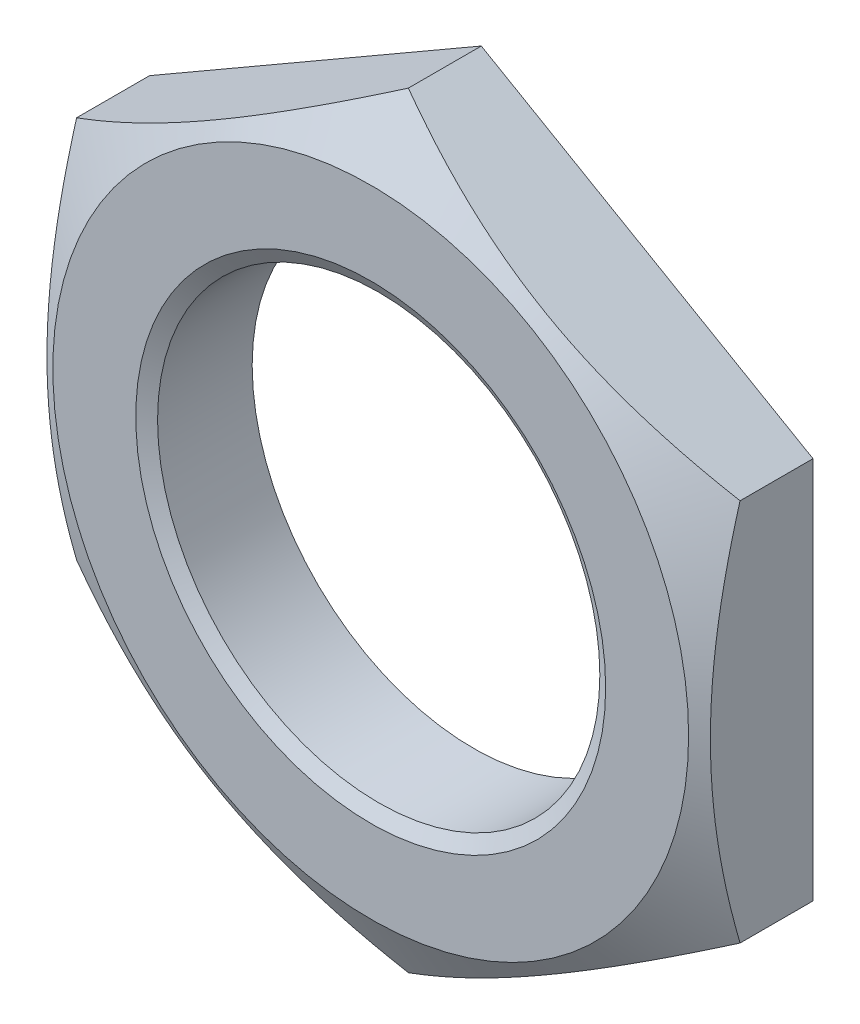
ISO-10303-21;
HEADER;
FILE_DESCRIPTION(('STEP AP214'),'2;1');
FILE_NAME('part.step','',(''),(''),'','','');
FILE_SCHEMA(('AUTOMOTIVE_DESIGN { 1 0 10303 214 1 1 1 1 }'));
ENDSEC;
DATA;
#1=APPLICATION_CONTEXT('core data for automotive mechanical design processes');
#2=APPLICATION_PROTOCOL_DEFINITION('international standard','automotive_design',2000,#1);
#3=PRODUCT_CONTEXT('',#1,'mechanical');
#4=PRODUCT('Part','Part','',(#3));
#5=PRODUCT_RELATED_PRODUCT_CATEGORY('part','',(#4));
#6=PRODUCT_DEFINITION_FORMATION('','',#4);
#7=PRODUCT_DEFINITION_CONTEXT('part definition',#1,'design');
#8=PRODUCT_DEFINITION('design','',#6,#7);
#9=PRODUCT_DEFINITION_SHAPE('','',#8);
#10=(LENGTH_UNIT() NAMED_UNIT(*) SI_UNIT(.MILLI.,.METRE.));
#11=(NAMED_UNIT(*) PLANE_ANGLE_UNIT() SI_UNIT($,.RADIAN.));
#12=(NAMED_UNIT(*) SI_UNIT($,.STERADIAN.) SOLID_ANGLE_UNIT());
#13=UNCERTAINTY_MEASURE_WITH_UNIT(LENGTH_MEASURE(1.E-05),#10,'distance_accuracy_value','');
#14=(GEOMETRIC_REPRESENTATION_CONTEXT(3) GLOBAL_UNCERTAINTY_ASSIGNED_CONTEXT((#13)) GLOBAL_UNIT_ASSIGNED_CONTEXT((#10,
#11,#12)) REPRESENTATION_CONTEXT('',''));
#15=CARTESIAN_POINT('',(0.,0.,0.));
#16=DIRECTION('',(0.,0.,1.));
#17=DIRECTION('',(1.,0.,0.));
#18=AXIS2_PLACEMENT_3D('',#15,#16,#17);
#19=CARTESIAN_POINT('',(-12.,-6.92820323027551,4.));
#20=DIRECTION('',(0.,0.,1.));
#21=DIRECTION('',(1.,0.,0.));
#22=AXIS2_PLACEMENT_3D('',#19,#20,#21);
#23=PLANE('',#22);
#24=CARTESIAN_POINT('',(0.,0.,4.));
#25=DIRECTION('',(0.,0.,1.));
#26=DIRECTION('',(1.,0.,0.));
#27=AXIS2_PLACEMENT_3D('',#24,#25,#26);
#28=CIRCLE('',#27,8.5);
#29=CARTESIAN_POINT('',(8.5,0.,4.));
#30=VERTEX_POINT('',#29);
#31=EDGE_CURVE('E23',#30,#30,#28,.F.);
#32=ORIENTED_EDGE('',*,*,#31,.T.);
#33=EDGE_LOOP('',(#32));
#34=FACE_BOUND('',#33,.T.);
#35=CARTESIAN_POINT('',(0.,0.,4.));
#36=DIRECTION('',(0.,0.,1.));
#37=DIRECTION('',(1.,0.,0.));
#38=AXIS2_PLACEMENT_3D('',#35,#36,#37);
#39=CIRCLE('',#38,11.5);
#40=CARTESIAN_POINT('',(11.5,0.,4.));
#41=VERTEX_POINT('',#40);
#42=EDGE_CURVE('E184',#41,#41,#39,.T.);
#43=ORIENTED_EDGE('',*,*,#42,.T.);
#44=EDGE_LOOP('',(#43));
#45=FACE_BOUND('',#44,.T.);
#46=ADVANCED_FACE('F14',(#34,#45),#23,.T.);
#47=CARTESIAN_POINT('',(-12.,6.92820323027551,4.));
#48=DIRECTION('',(1.,0.,0.));
#49=DIRECTION('',(0.,0.,-1.));
#50=AXIS2_PLACEMENT_3D('',#47,#48,#49);
#51=PLANE('',#50);
#52=CARTESIAN_POINT('',(-12.,-18.7026918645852,-2.19000402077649));
#53=CARTESIAN_POINT('',(-12.,-18.4402475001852,-2.06247742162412));
#54=CARTESIAN_POINT('',(-12.,-18.1774976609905,-1.93557977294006));
#55=CARTESIAN_POINT('',(-12.,-17.651323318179,-1.683184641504));
#56=CARTESIAN_POINT('',(-12.,-17.3878988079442,-1.55768717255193));
#57=CARTESIAN_POINT('',(-12.,-16.5964488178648,-1.18347595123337));
#58=CARTESIAN_POINT('',(-12.,-16.0673230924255,-0.937080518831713));
#59=CARTESIAN_POINT('',(-12.,-15.0027262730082,-0.450637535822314));
#60=CARTESIAN_POINT('',(-12.,-14.4672363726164,-0.210631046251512));
#61=CARTESIAN_POINT('',(-12.,-13.3920303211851,0.259686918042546));
#62=CARTESIAN_POINT('',(-12.,-12.8523143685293,0.48999884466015));
#63=CARTESIAN_POINT('',(-12.,-11.7500310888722,0.945710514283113));
#64=CARTESIAN_POINT('',(-12.,-11.1872942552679,1.17070236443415));
#65=CARTESIAN_POINT('',(-12.,-10.0552673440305,1.60388208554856));
#66=CARTESIAN_POINT('',(-12.,-9.48597654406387,1.81206808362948));
#67=CARTESIAN_POINT('',(-12.,-8.34099020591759,2.20623548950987));
#68=CARTESIAN_POINT('',(-12.,-7.76530999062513,2.39226105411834));
#69=CARTESIAN_POINT('',(-12.,-6.60563781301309,2.73621062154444));
#70=CARTESIAN_POINT('',(-12.,-6.02164850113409,2.89414337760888));
#71=CARTESIAN_POINT('',(-12.,-5.14094093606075,3.10387157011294));
#72=CARTESIAN_POINT('',(-12.,-4.84740487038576,3.16910884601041));
#73=CARTESIAN_POINT('',(-12.,-4.25830992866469,3.28975794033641));
#74=CARTESIAN_POINT('',(-12.,-3.96275109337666,3.34516995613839));
#75=CARTESIAN_POINT('',(-12.,-3.36980777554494,3.44519616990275));
#76=CARTESIAN_POINT('',(-12.,-3.07242332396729,3.48981055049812));
#77=CARTESIAN_POINT('',(-12.,-2.47613613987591,3.56735509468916));
#78=CARTESIAN_POINT('',(-12.,-2.17723346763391,3.60028571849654));
#79=CARTESIAN_POINT('',(-12.,-1.58227121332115,3.65339038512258));
#80=CARTESIAN_POINT('',(-12.,-1.2862262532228,3.67372724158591));
#81=CARTESIAN_POINT('',(-12.,-0.693541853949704,3.70185837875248));
#82=CARTESIAN_POINT('',(-12.,-0.396902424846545,3.70965287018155));
#83=CARTESIAN_POINT('',(-12.,0.196441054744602,3.7125135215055));
#84=CARTESIAN_POINT('',(-12.,0.49314510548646,3.70757963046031));
#85=CARTESIAN_POINT('',(-12.,1.08607871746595,3.6851049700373));
#86=CARTESIAN_POINT('',(-12.,1.38230825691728,3.66756363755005));
#87=CARTESIAN_POINT('',(-12.,2.09142576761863,3.61085738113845));
#88=CARTESIAN_POINT('',(-12.,2.50385629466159,3.56586723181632));
#89=CARTESIAN_POINT('',(-12.,3.32571990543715,3.45387669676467));
#90=CARTESIAN_POINT('',(-12.,3.73515258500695,3.38687339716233));
#91=CARTESIAN_POINT('',(-12.,4.55060757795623,3.2332398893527));
#92=CARTESIAN_POINT('',(-12.,4.95662704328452,3.14659470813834));
#93=CARTESIAN_POINT('',(-12.,5.76462450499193,2.95632632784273));
#94=CARTESIAN_POINT('',(-12.,6.16660255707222,2.85270336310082));
#95=CARTESIAN_POINT('',(-12.,6.9754650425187,2.62852726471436));
#96=CARTESIAN_POINT('',(-12.,7.38225831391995,2.50764748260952));
#97=CARTESIAN_POINT('',(-12.,8.19183855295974,2.25321174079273));
#98=CARTESIAN_POINT('',(-12.,8.5946254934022,2.11965569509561));
#99=CARTESIAN_POINT('',(-12.,9.39638951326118,1.84200441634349));
#100=CARTESIAN_POINT('',(-12.,9.79536776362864,1.69791254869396));
#101=CARTESIAN_POINT('',(-12.,10.5900051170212,1.40090320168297));
#102=CARTESIAN_POINT('',(-12.,10.9856642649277,1.2479858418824));
#103=CARTESIAN_POINT('',(-12.,11.9426036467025,0.867821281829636));
#104=CARTESIAN_POINT('',(-12.,12.5023625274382,0.636749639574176));
#105=CARTESIAN_POINT('',(-12.,13.6169231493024,0.162909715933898));
#106=CARTESIAN_POINT('',(-12.,14.1717245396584,-0.079859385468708));
#107=CARTESIAN_POINT('',(-12.,15.2773320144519,-0.574673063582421));
#108=CARTESIAN_POINT('',(-12.,15.8281370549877,-0.826719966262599));
#109=CARTESIAN_POINT('',(-12.,16.9263037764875,-1.33815265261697));
#110=CARTESIAN_POINT('',(-12.,17.4736655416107,-1.59753825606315));
#111=CARTESIAN_POINT('',(-12.,18.5661890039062,-2.12254630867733));
#112=CARTESIAN_POINT('',(-12.,19.111347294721,-2.38817583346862));
#113=CARTESIAN_POINT('',(-12.,20.1992771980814,-2.92427788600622));
#114=CARTESIAN_POINT('',(-12.,20.7420487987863,-3.19475043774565));
#115=CARTESIAN_POINT('',(-12.,21.8255045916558,-3.73964525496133));
#116=CARTESIAN_POINT('',(-12.,22.3661890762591,-4.01406693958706));
#117=CARTESIAN_POINT('',(-12.,23.4458588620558,-4.56623462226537));
#118=CARTESIAN_POINT('',(-12.,23.9848441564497,-4.84398063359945));
#119=CARTESIAN_POINT('',(-12.,25.5049720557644,-5.63229500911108));
#120=CARTESIAN_POINT('',(-12.,26.4844374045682,-6.14609747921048));
#121=CARTESIAN_POINT('',(-12.,28.4397743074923,-7.18057337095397));
#122=CARTESIAN_POINT('',(-12.,29.4156457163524,-7.70124706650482));
#123=CARTESIAN_POINT('',(-12.,31.3619734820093,-8.74642906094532));
#124=CARTESIAN_POINT('',(-12.,32.3324373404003,-9.27092339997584));
#125=CARTESIAN_POINT('',(-12.,33.7864498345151,-10.0606920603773));
#126=CARTESIAN_POINT('',(-12.,34.2708260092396,-10.324445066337));
#127=CARTESIAN_POINT('',(-12.,35.2390824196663,-10.8528581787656));
#128=CARTESIAN_POINT('',(-12.,35.7229626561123,-11.1175182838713));
#129=CARTESIAN_POINT('',(-12.,36.2066234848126,-11.3825788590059));
#130=B_SPLINE_CURVE_WITH_KNOTS('',3,(#52,#53,#54,#55,#56,#57,#58,#59,#60,#61,#62,#63,#64,#65,
#66,#67,#68,#69,#70,#71,#72,#73,#74,#75,#76,#77,#78,#79,#80,#81,#82,#83,#84,#85,#86,#87,#88,#89,
#90,#91,#92,#93,#94,#95,#96,#97,#98,#99,#100,#101,#102,#103,#104,#105,#106,#107,#108,#109,#110,
#111,#112,#113,#114,#115,#116,#117,#118,#119,#120,#121,#122,#123,#124,#125,#126,#127,#128,#129),
.UNSPECIFIED.,.F.,.F.,(4,2,2,2,2,2,2,2,2,2,2,2,2,2,2,2,2,2,2,2,2,2,2,2,2,2,2,2,2,2,2,2,2,2,2,2,
2,2,4),(0.,0.875361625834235,1.75073187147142,3.50172668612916,5.26209856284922,
7.02238829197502,8.84032706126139,10.6584681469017,12.4729235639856,14.2868126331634,
15.1887689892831,16.0907072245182,16.9926302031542,17.8945176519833,18.7844876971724,
19.6744427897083,20.5644014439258,21.45439985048,22.6983451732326,23.94245522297,
25.1875168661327,26.4325613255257,27.7054346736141,28.9783166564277,30.2507938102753,
31.5232537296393,33.3398021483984,35.1564780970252,36.9736126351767,38.7907025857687,
40.6099616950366,42.4292298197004,44.2482330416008,46.0672435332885,49.3853502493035,
52.7035896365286,56.0129644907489,57.6675553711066,59.3221437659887),.UNSPECIFIED.);
#131=CARTESIAN_POINT('',(-12.,6.92820323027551,2.63952809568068));
#132=VERTEX_POINT('',#131);
#133=CARTESIAN_POINT('',(-12.,-6.92820323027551,2.63952809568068));
#134=VERTEX_POINT('',#133);
#135=EDGE_CURVE('E69',#132,#134,#130,.F.);
#136=ORIENTED_EDGE('',*,*,#135,.F.);
#137=DIRECTION('',(0.,0.,-1.));
#138=VECTOR('',#137,1.);
#139=CARTESIAN_POINT('',(-12.,6.92820323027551,4.));
#140=LINE('',#139,#138);
#141=CARTESIAN_POINT('',(-12.,6.92820323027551,0.));
#142=VERTEX_POINT('',#141);
#143=EDGE_CURVE('E38',#132,#142,#140,.T.);
#144=ORIENTED_EDGE('',*,*,#143,.T.);
#145=DIRECTION('',(0.,-1.,0.));
#146=VECTOR('',#145,1.);
#147=CARTESIAN_POINT('',(-12.,6.92820323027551,0.));
#148=LINE('',#147,#146);
#149=CARTESIAN_POINT('',(-12.,-6.92820323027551,0.));
#150=VERTEX_POINT('',#149);
#151=EDGE_CURVE('E77',#142,#150,#148,.T.);
#152=ORIENTED_EDGE('',*,*,#151,.T.);
#153=DIRECTION('',(0.,0.,-1.));
#154=VECTOR('',#153,1.);
#155=CARTESIAN_POINT('',(-12.,-6.92820323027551,4.));
#156=LINE('',#155,#154);
#157=EDGE_CURVE('E73',#134,#150,#156,.T.);
#158=ORIENTED_EDGE('',*,*,#157,.F.);
#159=EDGE_LOOP('',(#136,#144,#152,#158));
#160=FACE_BOUND('',#159,.T.);
#161=ADVANCED_FACE('F76',(#160),#51,.F.);
#162=CARTESIAN_POINT('',(-12.,-6.92820323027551,4.));
#163=DIRECTION('',(0.5,0.866025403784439,0.));
#164=DIRECTION('',(-0.866025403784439,0.5,0.));
#165=AXIS2_PLACEMENT_3D('',#162,#163,#164);
#166=PLANE('',#165);
#167=CARTESIAN_POINT('',(-12.0002,-6.92808776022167,2.63946142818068));
#168=CARTESIAN_POINT('',(-11.7364142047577,-7.08038456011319,2.72737523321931));
#169=CARTESIAN_POINT('',(-11.4716448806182,-7.23324920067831,2.81129886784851));
#170=CARTESIAN_POINT('',(-10.9399829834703,-7.54020434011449,2.97005864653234));
#171=CARTESIAN_POINT('',(-10.6730897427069,-7.69429522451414,3.0448918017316));
#172=CARTESIAN_POINT('',(-9.86810959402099,-8.15905073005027,3.25430732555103));
#173=CARTESIAN_POINT('',(-9.3268449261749,-8.47155003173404,3.37342162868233));
#174=CARTESIAN_POINT('',(-8.51686717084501,-8.93919090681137,3.51309380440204));
#175=CARTESIAN_POINT('',(-8.25057389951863,-9.09293539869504,3.55288106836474));
#176=CARTESIAN_POINT('',(-7.71675440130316,-9.40113622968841,3.6196014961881));
#177=CARTESIAN_POINT('',(-7.44922815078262,-9.55559258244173,3.64653441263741));
#178=CARTESIAN_POINT('',(-6.91372963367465,-9.86476279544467,3.68685627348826));
#179=CARTESIAN_POINT('',(-6.64575827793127,-10.0194761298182,3.70026131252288));
#180=CARTESIAN_POINT('',(-6.10956726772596,-10.3290461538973,3.71324177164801));
#181=CARTESIAN_POINT('',(-5.84134762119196,-10.4839028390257,3.71281761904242));
#182=CARTESIAN_POINT('',(-5.33991062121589,-10.7734076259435,3.69910484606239));
#183=CARTESIAN_POINT('',(-5.10665750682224,-10.908076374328,3.68748888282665));
#184=CARTESIAN_POINT('',(-4.64068775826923,-11.1771041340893,3.65401685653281));
#185=CARTESIAN_POINT('',(-4.40797116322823,-11.3114631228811,3.63216006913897));
#186=CARTESIAN_POINT('',(-3.94320092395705,-11.5797983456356,3.57858744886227));
#187=CARTESIAN_POINT('',(-3.71114798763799,-11.7137741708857,3.54686347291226));
#188=CARTESIAN_POINT('',(-3.24813003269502,-11.9810977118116,3.47411308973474));
#189=CARTESIAN_POINT('',(-3.01716508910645,-12.1144453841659,3.43308605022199));
#190=CARTESIAN_POINT('',(-2.31605804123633,-12.5192297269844,3.29501321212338));
#191=CARTESIAN_POINT('',(-1.84794625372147,-12.789494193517,3.18419997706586));
#192=CARTESIAN_POINT('',(-0.918702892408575,-13.3259930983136,2.9326990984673));
#193=CARTESIAN_POINT('',(-0.457559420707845,-13.5922344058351,2.79207052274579));
#194=CARTESIAN_POINT('',(0.000199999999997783,-13.8565219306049,2.63946142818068));
#195=B_SPLINE_CURVE_WITH_KNOTS('',3,(#167,#168,#169,#170,#171,#172,#173,#174,#175,#176,#177,
#178,#179,#180,#181,#182,#183,#184,#185,#186,#187,#188,#189,#190,#191,#192,#193,#194),
.UNSPECIFIED.,.F.,.F.,(4,2,2,2,2,2,2,2,2,2,2,2,2,4),(0.,0.951004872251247,1.90232158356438,
3.80900466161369,4.73894551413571,5.6689042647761,6.59775529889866,7.52657763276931,
8.3351464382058,9.1437724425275,9.95306755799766,10.7624176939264,12.4167102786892,
14.0677556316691),.UNSPECIFIED.);
#196=CARTESIAN_POINT('',(0.,-13.856406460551,2.63952809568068));
#197=VERTEX_POINT('',#196);
#198=EDGE_CURVE('E78',#134,#197,#195,.T.);
#199=ORIENTED_EDGE('',*,*,#198,.F.);
#200=ORIENTED_EDGE('',*,*,#157,.T.);
#201=DIRECTION('',(0.866025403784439,-0.5,0.));
#202=VECTOR('',#201,1.);
#203=CARTESIAN_POINT('',(-12.,-6.92820323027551,0.));
#204=LINE('',#203,#202);
#205=CARTESIAN_POINT('',(0.,-13.856406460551,0.));
#206=VERTEX_POINT('',#205);
#207=EDGE_CURVE('E201',#150,#206,#204,.T.);
#208=ORIENTED_EDGE('',*,*,#207,.T.);
#209=DIRECTION('',(0.,0.,-1.));
#210=VECTOR('',#209,1.);
#211=CARTESIAN_POINT('',(0.,-13.856406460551,4.));
#212=LINE('',#211,#210);
#213=EDGE_CURVE('E95',#197,#206,#212,.T.);
#214=ORIENTED_EDGE('',*,*,#213,.F.);
#215=EDGE_LOOP('',(#199,#200,#208,#214));
#216=FACE_BOUND('',#215,.T.);
#217=ADVANCED_FACE('F156',(#216),#166,.F.);
#218=CARTESIAN_POINT('',(0.,-13.856406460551,4.));
#219=DIRECTION('',(-0.5,0.866025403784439,0.));
#220=DIRECTION('',(-0.866025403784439,-0.5,0.));
#221=AXIS2_PLACEMENT_3D('',#218,#219,#220);
#222=PLANE('',#221);
#223=CARTESIAN_POINT('',(-0.000200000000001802,-13.8565219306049,2.63946142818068));
#224=CARTESIAN_POINT('',(0.263585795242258,-13.7042251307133,2.72737523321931));
#225=CARTESIAN_POINT('',(0.528355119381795,-13.5513604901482,2.81129886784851));
#226=CARTESIAN_POINT('',(1.06001701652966,-13.244405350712,2.97005864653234));
#227=CARTESIAN_POINT('',(1.32691025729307,-13.0903144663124,3.0448918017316));
#228=CARTESIAN_POINT('',(2.13189040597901,-12.6255589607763,3.25430732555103));
#229=CARTESIAN_POINT('',(2.6731550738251,-12.3130596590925,3.37342162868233));
#230=CARTESIAN_POINT('',(3.483132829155,-11.8454187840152,3.51309380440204));
#231=CARTESIAN_POINT('',(3.74942610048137,-11.6916742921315,3.55288106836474));
#232=CARTESIAN_POINT('',(4.28324559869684,-11.3834734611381,3.6196014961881));
#233=CARTESIAN_POINT('',(4.55077184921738,-11.2290171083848,3.64653441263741));
#234=CARTESIAN_POINT('',(5.08627036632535,-10.9198468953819,3.68685627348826));
#235=CARTESIAN_POINT('',(5.35424172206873,-10.7651335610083,3.70026131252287));
#236=CARTESIAN_POINT('',(5.89043273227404,-10.4555635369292,3.71324177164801));
#237=CARTESIAN_POINT('',(6.15865237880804,-10.3007068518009,3.71281761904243));
#238=CARTESIAN_POINT('',(6.66008937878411,-10.011202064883,3.69910484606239));
#239=CARTESIAN_POINT('',(6.89334249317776,-9.87653331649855,3.68748888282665));
#240=CARTESIAN_POINT('',(7.35931224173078,-9.60750555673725,3.65401685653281));
#241=CARTESIAN_POINT('',(7.59202883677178,-9.47314656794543,3.63216006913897));
#242=CARTESIAN_POINT('',(8.05679907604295,-9.20481134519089,3.57858744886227));
#243=CARTESIAN_POINT('',(8.28885201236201,-9.07083551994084,3.54686347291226));
#244=CARTESIAN_POINT('',(8.75186996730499,-8.80351197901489,3.47411308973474));
#245=CARTESIAN_POINT('',(8.98283491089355,-8.67016430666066,3.43308605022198));
#246=CARTESIAN_POINT('',(9.68394195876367,-8.2653799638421,3.29501321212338));
#247=CARTESIAN_POINT('',(10.1520537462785,-7.99511549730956,3.18419997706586));
#248=CARTESIAN_POINT('',(11.0812971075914,-7.45861659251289,2.93269909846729));
#249=CARTESIAN_POINT('',(11.5424405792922,-7.19237528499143,2.79207052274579));
#250=CARTESIAN_POINT('',(12.0002,-6.92808776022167,2.63946142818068));
#251=B_SPLINE_CURVE_WITH_KNOTS('',3,(#223,#224,#225,#226,#227,#228,#229,#230,#231,#232,#233,
#234,#235,#236,#237,#238,#239,#240,#241,#242,#243,#244,#245,#246,#247,#248,#249,#250),
.UNSPECIFIED.,.F.,.F.,(4,2,2,2,2,2,2,2,2,2,2,2,2,4),(0.,0.951004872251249,1.90232158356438,
3.80900466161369,4.73894551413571,5.6689042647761,6.59775529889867,7.52657763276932,
8.3351464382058,9.14377244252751,9.95306755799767,10.7624176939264,12.4167102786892,
14.0677556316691),.UNSPECIFIED.);
#252=CARTESIAN_POINT('',(12.,-6.9282032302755,2.63952809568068));
#253=VERTEX_POINT('',#252);
#254=EDGE_CURVE('E141',#197,#253,#251,.T.);
#255=ORIENTED_EDGE('',*,*,#254,.F.);
#256=ORIENTED_EDGE('',*,*,#213,.T.);
#257=DIRECTION('',(0.866025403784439,0.5,0.));
#258=VECTOR('',#257,1.);
#259=CARTESIAN_POINT('',(0.,-13.856406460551,0.));
#260=LINE('',#259,#258);
#261=CARTESIAN_POINT('',(12.,-6.9282032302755,0.));
#262=VERTEX_POINT('',#261);
#263=EDGE_CURVE('E202',#206,#262,#260,.T.);
#264=ORIENTED_EDGE('',*,*,#263,.T.);
#265=DIRECTION('',(0.,0.,-1.));
#266=VECTOR('',#265,1.);
#267=CARTESIAN_POINT('',(12.,-6.9282032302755,4.));
#268=LINE('',#267,#266);
#269=EDGE_CURVE('E93',#253,#262,#268,.T.);
#270=ORIENTED_EDGE('',*,*,#269,.F.);
#271=EDGE_LOOP('',(#255,#256,#264,#270));
#272=FACE_BOUND('',#271,.T.);
#273=ADVANCED_FACE('F152',(#272),#222,.F.);
#274=CARTESIAN_POINT('',(12.,-6.9282032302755,4.));
#275=DIRECTION('',(-1.,0.,0.));
#276=DIRECTION('',(0.,-1.,0.));
#277=AXIS2_PLACEMENT_3D('',#274,#275,#276);
#278=PLANE('',#277);
#279=CARTESIAN_POINT('',(12.,-18.7026918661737,-2.1900040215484));
#280=CARTESIAN_POINT('',(12.,-18.440247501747,-2.06247742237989));
#281=CARTESIAN_POINT('',(12.,-18.1774976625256,-1.93557977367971));
#282=CARTESIAN_POINT('',(12.,-17.6513233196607,-1.68318464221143));
#283=CARTESIAN_POINT('',(12.,-17.3878988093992,-1.55768717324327));
#284=CARTESIAN_POINT('',(12.,-16.5964488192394,-1.18347595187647));
#285=CARTESIAN_POINT('',(12.,-16.0673230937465,-0.937080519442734));
#286=CARTESIAN_POINT('',(12.,-15.0027262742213,-0.450637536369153));
#287=CARTESIAN_POINT('',(12.,-14.467236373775,-0.210631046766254));
#288=CARTESIAN_POINT('',(12.,-13.3920303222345,0.259686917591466));
#289=CARTESIAN_POINT('',(12.,-12.8523143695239,0.489998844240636));
#290=CARTESIAN_POINT('',(12.,-11.750031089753,0.945710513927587));
#291=CARTESIAN_POINT('',(12.,-11.1872942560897,1.17070236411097));
#292=CARTESIAN_POINT('',(12.,-10.0552673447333,1.60388208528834));
#293=CARTESIAN_POINT('',(12.,-9.4859765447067,1.81206808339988));
#294=CARTESIAN_POINT('',(12.,-8.34099020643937,2.20623548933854));
#295=CARTESIAN_POINT('',(12.,-7.76530999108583,2.39226105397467));
#296=CARTESIAN_POINT('',(12.,-6.60563781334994,2.73621062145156));
#297=CARTESIAN_POINT('',(12.,-6.02164850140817,2.89414337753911));
#298=CARTESIAN_POINT('',(12.,-5.14094093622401,3.1038715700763));
#299=CARTESIAN_POINT('',(12.,-4.84740487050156,3.16910884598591));
#300=CARTESIAN_POINT('',(12.,-4.2583099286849,3.28975794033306));
#301=CARTESIAN_POINT('',(12.,-3.96275109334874,3.34516995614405));
#302=CARTESIAN_POINT('',(12.,-3.36980777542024,3.44519616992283));
#303=CARTESIAN_POINT('',(12.,-3.07242332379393,3.48981055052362));
#304=CARTESIAN_POINT('',(12.,-2.47613613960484,3.56735509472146));
#305=CARTESIAN_POINT('',(12.,-2.17723346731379,3.60028571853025));
#306=CARTESIAN_POINT('',(12.,-1.58227121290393,3.65339038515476));
#307=CARTESIAN_POINT('',(12.,-1.28622625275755,3.67372724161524));
#308=CARTESIAN_POINT('',(12.,-0.6935418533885,3.70185837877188));
#309=CARTESIAN_POINT('',(12.,-0.396902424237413,3.70965287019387));
#310=CARTESIAN_POINT('',(12.,0.196441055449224,3.71251352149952));
#311=CARTESIAN_POINT('',(12.,0.493145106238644,3.70757963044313));
#312=CARTESIAN_POINT('',(12.,1.08607871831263,3.68510496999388));
#313=CARTESIAN_POINT('',(12.,1.38230825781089,3.6675636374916));
#314=CARTESIAN_POINT('',(12.,2.09142576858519,3.61085738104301));
#315=CARTESIAN_POINT('',(12.,2.50385629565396,3.56586723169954));
#316=CARTESIAN_POINT('',(12.,3.32571990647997,3.4538766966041));
#317=CARTESIAN_POINT('',(12.,3.73515258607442,3.38687339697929));
#318=CARTESIAN_POINT('',(12.,4.5506075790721,3.23323988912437));
#319=CARTESIAN_POINT('',(12.,4.95662704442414,3.14659470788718));
#320=CARTESIAN_POINT('',(12.,5.76462450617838,2.95632632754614));
#321=CARTESIAN_POINT('',(12.,6.16660255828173,2.85270336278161));
#322=CARTESIAN_POINT('',(12.,6.97546504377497,2.62852726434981));
#323=CARTESIAN_POINT('',(12.,7.3822583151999,2.50764748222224));
#324=CARTESIAN_POINT('',(12.,8.19183855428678,2.25321174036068));
#325=CARTESIAN_POINT('',(12.,8.59462549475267,2.11965569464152));
#326=CARTESIAN_POINT('',(12.,9.39638951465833,1.84200441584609));
#327=CARTESIAN_POINT('',(12.,9.79536776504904,1.69791254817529));
#328=CARTESIAN_POINT('',(12.,10.5900051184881,1.40090320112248));
#329=CARTESIAN_POINT('',(12.,10.9856642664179,1.24798584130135));
#330=CARTESIAN_POINT('',(12.,11.9426036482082,0.867821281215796));
#331=CARTESIAN_POINT('',(12.,12.5023625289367,0.636749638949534));
#332=CARTESIAN_POINT('',(12.,13.6169231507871,0.162909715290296));
#333=CARTESIAN_POINT('',(12.,14.1717245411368,-0.0798593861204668));
#334=CARTESIAN_POINT('',(12.,15.2773320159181,-0.574673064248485));
#335=CARTESIAN_POINT('',(12.,15.8281370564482,-0.82671996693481));
#336=CARTESIAN_POINT('',(12.,16.9263037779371,-1.33815265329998));
#337=CARTESIAN_POINT('',(12.,17.4736655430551,-1.59753825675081));
#338=CARTESIAN_POINT('',(12.,18.5661890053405,-2.12254630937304));
#339=CARTESIAN_POINT('',(12.,19.1113472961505,-2.38817583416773));
#340=CARTESIAN_POINT('',(12.,20.1992771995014,-2.92427788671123));
#341=CARTESIAN_POINT('',(12.,20.7420488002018,-3.19475043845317));
#342=CARTESIAN_POINT('',(12.,21.8255045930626,-3.73964525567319));
#343=CARTESIAN_POINT('',(12.,22.3661890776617,-4.01406694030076));
#344=CARTESIAN_POINT('',(12.,23.4458588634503,-4.56623462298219));
#345=CARTESIAN_POINT('',(12.,23.9848441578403,-4.84398063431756));
#346=CARTESIAN_POINT('',(12.,25.5049720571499,-5.63229500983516));
#347=CARTESIAN_POINT('',(12.,26.4844374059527,-6.1460974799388));
#348=CARTESIAN_POINT('',(12.,28.4397743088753,-7.18057337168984));
#349=CARTESIAN_POINT('',(12.,29.4156457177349,-7.70124706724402));
#350=CARTESIAN_POINT('',(12.,31.361973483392,-8.74642906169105));
#351=CARTESIAN_POINT('',(12.,32.3324373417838,-9.2709234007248));
#352=CARTESIAN_POINT('',(12.,33.7864498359,-10.0606920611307));
#353=CARTESIAN_POINT('',(12.,34.270826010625,-10.3244450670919));
#354=CARTESIAN_POINT('',(12.,35.2390824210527,-10.8528581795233));
#355=CARTESIAN_POINT('',(12.,35.7229626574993,-11.1175182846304));
#356=CARTESIAN_POINT('',(12.,36.2066234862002,-11.3825788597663));
#357=B_SPLINE_CURVE_WITH_KNOTS('',3,(#279,#280,#281,#282,#283,#284,#285,#286,#287,#288,#289,
#290,#291,#292,#293,#294,#295,#296,#297,#298,#299,#300,#301,#302,#303,#304,#305,#306,#307,#308,
#309,#310,#311,#312,#313,#314,#315,#316,#317,#318,#319,#320,#321,#322,#323,#324,#325,#326,#327,
#328,#329,#330,#331,#332,#333,#334,#335,#336,#337,#338,#339,#340,#341,#342,#343,#344,#345,#346,
#347,#348,#349,#350,#351,#352,#353,#354,#355,#356),.UNSPECIFIED.,.F.,.F.,(4,2,2,2,2,2,2,2,2,2,2,
2,2,2,2,2,2,2,2,2,2,2,2,2,2,2,2,2,2,2,2,2,2,2,2,2,2,2,4),(0.,0.875361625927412,1.75073187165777,
3.5017266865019,5.26209856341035,7.02238829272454,8.8403270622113,10.6584681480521,
12.4729235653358,14.2868126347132,15.1887689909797,16.0907072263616,16.9926302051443,
17.89451765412,18.7844876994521,19.6744427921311,20.5644014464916,21.4543998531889,
22.6983451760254,23.9424552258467,25.1875168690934,26.4325613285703,27.7054346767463,
28.9783166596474,30.2507938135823,31.5232537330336,33.3398021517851,35.1564781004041,
36.9736126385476,38.7907025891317,40.6099616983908,42.4292298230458,44.2482330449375,
46.0672435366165,49.3853502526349,52.7035896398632,56.0129644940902,57.6675553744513,
59.3221437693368),.UNSPECIFIED.);
#358=CARTESIAN_POINT('',(12.,6.92820323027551,2.63952809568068));
#359=VERTEX_POINT('',#358);
#360=EDGE_CURVE('E134',#253,#359,#357,.T.);
#361=ORIENTED_EDGE('',*,*,#360,.F.);
#362=ORIENTED_EDGE('',*,*,#269,.T.);
#363=DIRECTION('',(0.,1.,0.));
#364=VECTOR('',#363,1.);
#365=CARTESIAN_POINT('',(12.,-6.9282032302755,0.));
#366=LINE('',#365,#364);
#367=CARTESIAN_POINT('',(12.,6.92820323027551,0.));
#368=VERTEX_POINT('',#367);
#369=EDGE_CURVE('E207',#262,#368,#366,.T.);
#370=ORIENTED_EDGE('',*,*,#369,.T.);
#371=DIRECTION('',(0.,0.,-1.));
#372=VECTOR('',#371,1.);
#373=CARTESIAN_POINT('',(12.,6.92820323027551,4.));
#374=LINE('',#373,#372);
#375=EDGE_CURVE('E86',#359,#368,#374,.T.);
#376=ORIENTED_EDGE('',*,*,#375,.F.);
#377=EDGE_LOOP('',(#361,#362,#370,#376));
#378=FACE_BOUND('',#377,.T.);
#379=ADVANCED_FACE('F155',(#378),#278,.F.);
#380=CARTESIAN_POINT('',(12.,6.92820323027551,4.));
#381=DIRECTION('',(-0.5,-0.866025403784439,0.));
#382=DIRECTION('',(0.866025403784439,-0.5,0.));
#383=AXIS2_PLACEMENT_3D('',#380,#381,#382);
#384=PLANE('',#383);
#385=CARTESIAN_POINT('',(12.0002,6.92808776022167,2.63946142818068));
#386=CARTESIAN_POINT('',(11.7364142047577,7.08038456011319,2.72737523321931));
#387=CARTESIAN_POINT('',(11.4716448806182,7.23324920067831,2.81129886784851));
#388=CARTESIAN_POINT('',(10.9399829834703,7.54020434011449,2.97005864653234));
#389=CARTESIAN_POINT('',(10.6730897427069,7.69429522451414,3.0448918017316));
#390=CARTESIAN_POINT('',(9.86810959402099,8.15905073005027,3.25430732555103));
#391=CARTESIAN_POINT('',(9.3268449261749,8.47155003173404,3.37342162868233));
#392=CARTESIAN_POINT('',(8.51686717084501,8.93919090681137,3.51309380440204));
#393=CARTESIAN_POINT('',(8.25057389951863,9.09293539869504,3.55288106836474));
#394=CARTESIAN_POINT('',(7.71675440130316,9.40113622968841,3.6196014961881));
#395=CARTESIAN_POINT('',(7.44922815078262,9.55559258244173,3.64653441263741));
#396=CARTESIAN_POINT('',(6.91372963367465,9.86476279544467,3.68685627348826));
#397=CARTESIAN_POINT('',(6.64575827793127,10.0194761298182,3.70026131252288));
#398=CARTESIAN_POINT('',(6.10956726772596,10.3290461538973,3.71324177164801));
#399=CARTESIAN_POINT('',(5.84134762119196,10.4839028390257,3.71281761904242));
#400=CARTESIAN_POINT('',(5.33991062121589,10.7734076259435,3.69910484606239));
#401=CARTESIAN_POINT('',(5.10665750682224,10.908076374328,3.68748888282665));
#402=CARTESIAN_POINT('',(4.64068775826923,11.1771041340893,3.65401685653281));
#403=CARTESIAN_POINT('',(4.40797116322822,11.3114631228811,3.63216006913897));
#404=CARTESIAN_POINT('',(3.94320092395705,11.5797983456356,3.57858744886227));
#405=CARTESIAN_POINT('',(3.71114798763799,11.7137741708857,3.54686347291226));
#406=CARTESIAN_POINT('',(3.24813003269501,11.9810977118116,3.47411308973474));
#407=CARTESIAN_POINT('',(3.01716508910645,12.1144453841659,3.43308605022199));
#408=CARTESIAN_POINT('',(2.31605804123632,12.5192297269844,3.29501321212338));
#409=CARTESIAN_POINT('',(1.84794625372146,12.789494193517,3.18419997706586));
#410=CARTESIAN_POINT('',(0.918702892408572,13.3259930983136,2.9326990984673));
#411=CARTESIAN_POINT('',(0.457559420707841,13.5922344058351,2.79207052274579));
#412=CARTESIAN_POINT('',(-0.00019999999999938,13.8565219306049,2.63946142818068));
#413=B_SPLINE_CURVE_WITH_KNOTS('',3,(#385,#386,#387,#388,#389,#390,#391,#392,#393,#394,#395,
#396,#397,#398,#399,#400,#401,#402,#403,#404,#405,#406,#407,#408,#409,#410,#411,#412),
.UNSPECIFIED.,.F.,.F.,(4,2,2,2,2,2,2,2,2,2,2,2,2,4),(0.,0.951004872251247,1.90232158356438,
3.80900466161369,4.73894551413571,5.6689042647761,6.59775529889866,7.52657763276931,
8.3351464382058,9.1437724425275,9.95306755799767,10.7624176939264,12.4167102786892,
14.0677556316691),.UNSPECIFIED.);
#414=CARTESIAN_POINT('',(0.,13.856406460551,2.63952809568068));
#415=VERTEX_POINT('',#414);
#416=EDGE_CURVE('E30',#359,#415,#413,.T.);
#417=ORIENTED_EDGE('',*,*,#416,.F.);
#418=ORIENTED_EDGE('',*,*,#375,.T.);
#419=DIRECTION('',(-0.866025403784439,0.5,0.));
#420=VECTOR('',#419,1.);
#421=CARTESIAN_POINT('',(12.,6.92820323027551,0.));
#422=LINE('',#421,#420);
#423=CARTESIAN_POINT('',(0.,13.856406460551,0.));
#424=VERTEX_POINT('',#423);
#425=EDGE_CURVE('E88',#368,#424,#422,.T.);
#426=ORIENTED_EDGE('',*,*,#425,.T.);
#427=DIRECTION('',(0.,0.,-1.));
#428=VECTOR('',#427,1.);
#429=CARTESIAN_POINT('',(0.,13.856406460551,4.));
#430=LINE('',#429,#428);
#431=EDGE_CURVE('E84',#415,#424,#430,.T.);
#432=ORIENTED_EDGE('',*,*,#431,.F.);
#433=EDGE_LOOP('',(#417,#418,#426,#432));
#434=FACE_BOUND('',#433,.T.);
#435=ADVANCED_FACE('F211',(#434),#384,.F.);
#436=CARTESIAN_POINT('',(0.,13.856406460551,4.));
#437=DIRECTION('',(0.5,-0.866025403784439,0.));
#438=DIRECTION('',(0.866025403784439,0.5,0.));
#439=AXIS2_PLACEMENT_3D('',#436,#437,#438);
#440=PLANE('',#439);
#441=CARTESIAN_POINT('',(0.000200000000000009,13.8565219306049,2.63946142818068));
#442=CARTESIAN_POINT('',(-0.263585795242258,13.7042251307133,2.72737523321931));
#443=CARTESIAN_POINT('',(-0.528355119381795,13.5513604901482,2.81129886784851));
#444=CARTESIAN_POINT('',(-1.06001701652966,13.244405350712,2.97005864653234));
#445=CARTESIAN_POINT('',(-1.32691025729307,13.0903144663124,3.0448918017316));
#446=CARTESIAN_POINT('',(-2.13189040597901,12.6255589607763,3.25430732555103));
#447=CARTESIAN_POINT('',(-2.6731550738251,12.3130596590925,3.37342162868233));
#448=CARTESIAN_POINT('',(-3.483132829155,11.8454187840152,3.51309380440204));
#449=CARTESIAN_POINT('',(-3.74942610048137,11.6916742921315,3.55288106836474));
#450=CARTESIAN_POINT('',(-4.28324559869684,11.3834734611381,3.61960149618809));
#451=CARTESIAN_POINT('',(-4.55077184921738,11.2290171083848,3.64653441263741));
#452=CARTESIAN_POINT('',(-5.08627036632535,10.9198468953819,3.68685627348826));
#453=CARTESIAN_POINT('',(-5.35424172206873,10.7651335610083,3.70026131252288));
#454=CARTESIAN_POINT('',(-5.89043273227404,10.4555635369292,3.71324177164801));
#455=CARTESIAN_POINT('',(-6.15865237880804,10.3007068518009,3.71281761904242));
#456=CARTESIAN_POINT('',(-6.66008937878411,10.011202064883,3.69910484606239));
#457=CARTESIAN_POINT('',(-6.89334249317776,9.87653331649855,3.68748888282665));
#458=CARTESIAN_POINT('',(-7.35931224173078,9.60750555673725,3.65401685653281));
#459=CARTESIAN_POINT('',(-7.59202883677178,9.47314656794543,3.63216006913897));
#460=CARTESIAN_POINT('',(-8.05679907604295,9.20481134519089,3.57858744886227));
#461=CARTESIAN_POINT('',(-8.28885201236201,9.07083551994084,3.54686347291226));
#462=CARTESIAN_POINT('',(-8.75186996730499,8.80351197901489,3.47411308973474));
#463=CARTESIAN_POINT('',(-8.98283491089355,8.67016430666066,3.43308605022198));
#464=CARTESIAN_POINT('',(-9.68394195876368,8.2653799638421,3.29501321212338));
#465=CARTESIAN_POINT('',(-10.1520537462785,7.99511549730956,3.18419997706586));
#466=CARTESIAN_POINT('',(-11.0812971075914,7.45861659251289,2.9326990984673));
#467=CARTESIAN_POINT('',(-11.5424405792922,7.19237528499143,2.79207052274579));
#468=CARTESIAN_POINT('',(-12.0002,6.92808776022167,2.63946142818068));
#469=B_SPLINE_CURVE_WITH_KNOTS('',3,(#441,#442,#443,#444,#445,#446,#447,#448,#449,#450,#451,
#452,#453,#454,#455,#456,#457,#458,#459,#460,#461,#462,#463,#464,#465,#466,#467,#468),
.UNSPECIFIED.,.F.,.F.,(4,2,2,2,2,2,2,2,2,2,2,2,2,4),(0.,0.951004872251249,1.90232158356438,
3.80900466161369,4.73894551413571,5.6689042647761,6.59775529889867,7.52657763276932,
8.3351464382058,9.14377244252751,9.95306755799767,10.7624176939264,12.4167102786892,
14.0677556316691),.UNSPECIFIED.);
#470=EDGE_CURVE('E67',#415,#132,#469,.T.);
#471=ORIENTED_EDGE('',*,*,#470,.F.);
#472=ORIENTED_EDGE('',*,*,#431,.T.);
#473=DIRECTION('',(-0.866025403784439,-0.5,0.));
#474=VECTOR('',#473,1.);
#475=CARTESIAN_POINT('',(0.,13.856406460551,0.));
#476=LINE('',#475,#474);
#477=EDGE_CURVE('E82',#424,#142,#476,.T.);
#478=ORIENTED_EDGE('',*,*,#477,.T.);
#479=ORIENTED_EDGE('',*,*,#143,.F.);
#480=EDGE_LOOP('',(#471,#472,#478,#479));
#481=FACE_BOUND('',#480,.T.);
#482=ADVANCED_FACE('F80',(#481),#440,.F.);
#483=CARTESIAN_POINT('',(-12.,-6.92820323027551,0.));
#484=DIRECTION('',(0.,0.,1.));
#485=DIRECTION('',(1.,0.,0.));
#486=AXIS2_PLACEMENT_3D('',#483,#484,#485);
#487=PLANE('',#486);
#488=CARTESIAN_POINT('',(0.,0.,0.));
#489=DIRECTION('',(0.,0.,1.));
#490=DIRECTION('',(1.,0.,0.));
#491=AXIS2_PLACEMENT_3D('',#488,#489,#490);
#492=CIRCLE('',#491,8.5);
#493=CARTESIAN_POINT('',(8.5,0.,0.));
#494=VERTEX_POINT('',#493);
#495=EDGE_CURVE('E9',#494,#494,#492,.T.);
#496=ORIENTED_EDGE('',*,*,#495,.T.);
#497=EDGE_LOOP('',(#496));
#498=FACE_BOUND('',#497,.T.);
#499=ORIENTED_EDGE('',*,*,#151,.F.);
#500=ORIENTED_EDGE('',*,*,#477,.F.);
#501=ORIENTED_EDGE('',*,*,#425,.F.);
#502=ORIENTED_EDGE('',*,*,#369,.F.);
#503=ORIENTED_EDGE('',*,*,#263,.F.);
#504=ORIENTED_EDGE('',*,*,#207,.F.);
#505=EDGE_LOOP('',(#499,#500,#501,#502,#503,#504));
#506=FACE_BOUND('',#505,.T.);
#507=ADVANCED_FACE('F112',(#498,#506),#487,.F.);
#508=CARTESIAN_POINT('',(0.,0.,4.));
#509=DIRECTION('',(0.,0.,-1.));
#510=DIRECTION('',(1.,0.,0.));
#511=AXIS2_PLACEMENT_3D('',#508,#509,#510);
#512=CONICAL_SURFACE('',#511,11.5,1.0471975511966);
#513=ORIENTED_EDGE('',*,*,#42,.F.);
#514=EDGE_LOOP('',(#513));
#515=FACE_BOUND('',#514,.T.);
#516=ORIENTED_EDGE('',*,*,#135,.T.);
#517=ORIENTED_EDGE('',*,*,#198,.T.);
#518=ORIENTED_EDGE('',*,*,#254,.T.);
#519=ORIENTED_EDGE('',*,*,#360,.T.);
#520=ORIENTED_EDGE('',*,*,#416,.T.);
#521=ORIENTED_EDGE('',*,*,#470,.T.);
#522=EDGE_LOOP('',(#516,#517,#518,#519,#520,#521));
#523=FACE_BOUND('',#522,.T.);
#524=ADVANCED_FACE('F68',(#515,#523),#512,.T.);
#525=CARTESIAN_POINT('',(0.,0.,3.42264973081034));
#526=DIRECTION('',(0.,0.,1.));
#527=DIRECTION('',(1.,0.,0.));
#528=AXIS2_PLACEMENT_3D('',#525,#526,#527);
#529=CONICAL_SURFACE('',#528,7.5,1.0471975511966);
#530=CARTESIAN_POINT('',(0.,0.,3.71132486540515));
#531=DIRECTION('',(0.,0.,1.));
#532=DIRECTION('',(1.,0.,0.));
#533=AXIS2_PLACEMENT_3D('',#530,#531,#532);
#534=CIRCLE('',#533,8.);
#535=CARTESIAN_POINT('',(8.,0.,3.71132486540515));
#536=VERTEX_POINT('',#535);
#537=EDGE_CURVE('E185',#536,#536,#534,.T.);
#538=ORIENTED_EDGE('',*,*,#537,.F.);
#539=EDGE_LOOP('',(#538));
#540=FACE_BOUND('',#539,.T.);
#541=ORIENTED_EDGE('',*,*,#31,.F.);
#542=EDGE_LOOP('',(#541));
#543=FACE_BOUND('',#542,.T.);
#544=ADVANCED_FACE('F111',(#540,#543),#529,.F.);
#545=CARTESIAN_POINT('',(0.,0.,0.));
#546=DIRECTION('',(0.,0.,-1.));
#547=DIRECTION('',(-1.,0.,0.));
#548=AXIS2_PLACEMENT_3D('',#545,#546,#547);
#549=CONICAL_SURFACE('',#548,8.5,1.0471975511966);
#550=CARTESIAN_POINT('',(0.,0.,0.288675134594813));
#551=DIRECTION('',(0.,0.,-1.));
#552=DIRECTION('',(-1.,0.,0.));
#553=AXIS2_PLACEMENT_3D('',#550,#551,#552);
#554=CIRCLE('',#553,8.);
#555=CARTESIAN_POINT('',(-8.,0.,0.288675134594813));
#556=VERTEX_POINT('',#555);
#557=EDGE_CURVE('E18',#556,#556,#554,.T.);
#558=ORIENTED_EDGE('',*,*,#557,.F.);
#559=EDGE_LOOP('',(#558));
#560=FACE_BOUND('',#559,.T.);
#561=ORIENTED_EDGE('',*,*,#495,.F.);
#562=EDGE_LOOP('',(#561));
#563=FACE_BOUND('',#562,.T.);
#564=ADVANCED_FACE('F16',(#560,#563),#549,.F.);
#565=CARTESIAN_POINT('',(0.,0.,10.));
#566=DIRECTION('',(0.,0.,-1.));
#567=DIRECTION('',(-1.,0.,0.));
#568=AXIS2_PLACEMENT_3D('',#565,#566,#567);
#569=CYLINDRICAL_SURFACE('',#568,8.);
#570=ORIENTED_EDGE('',*,*,#537,.T.);
#571=EDGE_LOOP('',(#570));
#572=FACE_BOUND('',#571,.T.);
#573=ORIENTED_EDGE('',*,*,#557,.T.);
#574=EDGE_LOOP('',(#573));
#575=FACE_BOUND('',#574,.T.);
#576=ADVANCED_FACE('F114',(#572,#575),#569,.F.);
#577=CLOSED_SHELL('',(#46,#161,#217,#273,#379,#435,#482,#507,#524,#544,#564,#576));
#578=MANIFOLD_SOLID_BREP('B1',#577);
#579=ADVANCED_BREP_SHAPE_REPRESENTATION('',(#18,#578),#14);
#580=SHAPE_DEFINITION_REPRESENTATION(#9,#579);
ENDSEC;
END-ISO-10303-21;
